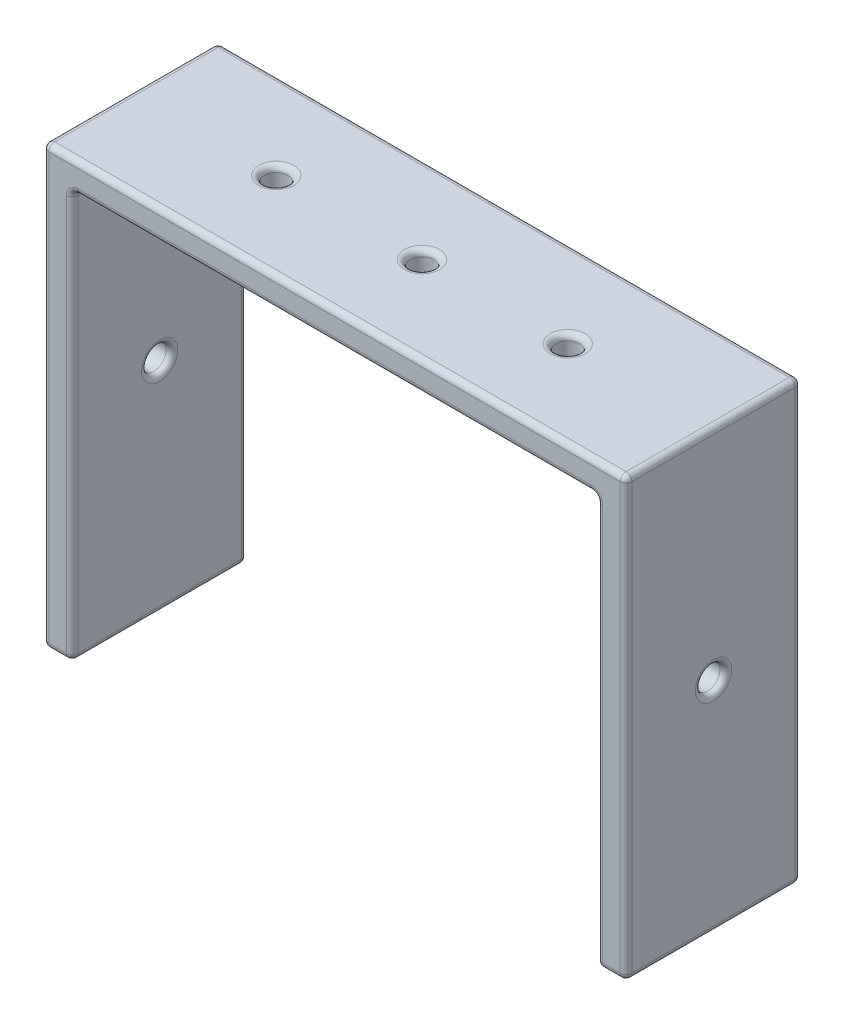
from build123d import *

# Parameters (mm, degrees)
BOSS_EXTRUDE1_DEPTH = 60
SKETCH2_R           = 4.2
CUT_EXTRUDE1_DEPTH  = 210
SKETCH4_R           = 4
CUT_EXTRUDE2_DEPTH  = 210
FILLET1_R           = 2


with BuildPart() as part:
    # Sketch1 → Boss-Extrude1 (new body)
    with BuildSketch(Plane.XY):
        Polygon((-100, 110.544921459), (100, 110.544921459), (100, -39.455078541), (90, -39.455078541), (90, -29.455078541), (90, 100.544921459), (-90, 100.544921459), (-90, -29.455078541), (-90, -39.455078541), (-100, -39.455078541), align=None)
    extrude(amount=BOSS_EXTRUDE1_DEPTH)

    # Sketch2 → Cut-Extrude1 (cut)
    with BuildSketch(Plane.ZY.offset(100)):
        with Locations(Location((30, 35.544921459, 0), (0, 0, 270))):
            Circle(SKETCH2_R)
    extrude(amount=-CUT_EXTRUDE1_DEPTH, mode=Mode.SUBTRACT)

    # Sketch4 → Cut-Extrude2 (cut)
    with BuildSketch(Plane(origin=(0, 110.544921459, 0), x_dir=(1, 0, 0), z_dir=(0, 1, 0))):
        with Locations(Location((-50, -30, 0), (0, 0, 270))):
            Circle(SKETCH4_R)
        with Locations(Location((0, -30, 0), (0, 0, 270))):
            Circle(SKETCH4_R)
        with Locations(Location((50, -30, 0), (0, 0, 270))):
            Circle(SKETCH4_R)
    extrude(amount=-CUT_EXTRUDE2_DEPTH, mode=Mode.SUBTRACT)

    # Fillet1
    fillet1_edges = [part.edges().sort_by_distance(p)[0] for p in [
        (-90, 30.544921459, 60),
        (95, -39.455078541, 0),
        (90, 30.544921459, 0),
        (0, 100.544921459, 0),
        (-90, 30.544921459, 0),
        (-95, -39.455078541, 0),
        (-100, 35.544921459, 0),
        (0, 100.544921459, 60),
        (-100, 110.544921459, 30),
        (100, 110.544921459, 30),
        (100, -39.455078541, 30),
        (90, -39.455078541, 30),
        (90, 100.544921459, 30),
        (-90, 100.544921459, 30),
        (-90, -39.455078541, 30),
        (-100, -39.455078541, 30),
        (90, 30.544921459, 60),
        (95, -39.455078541, 60),
        (100, 35.544921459, 60),
        (0, 110.544921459, 60),
        (-90, 39.744921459, 30),
        (100, 39.744921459, 30),
        (90, 39.744921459, 30),
        (-100, 39.744921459, 30),
        (-100, 35.544921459, 60),
        (-50, 110.544921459, 26),
        (0, 110.544921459, 26),
        (50, 110.544921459, 26),
        (-95, -39.455078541, 60),
        (0, 110.544921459, 0),
        (100, 35.544921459, 0),
    ]]
    fillet(fillet1_edges, radius=FILLET1_R)


solid = part.part
